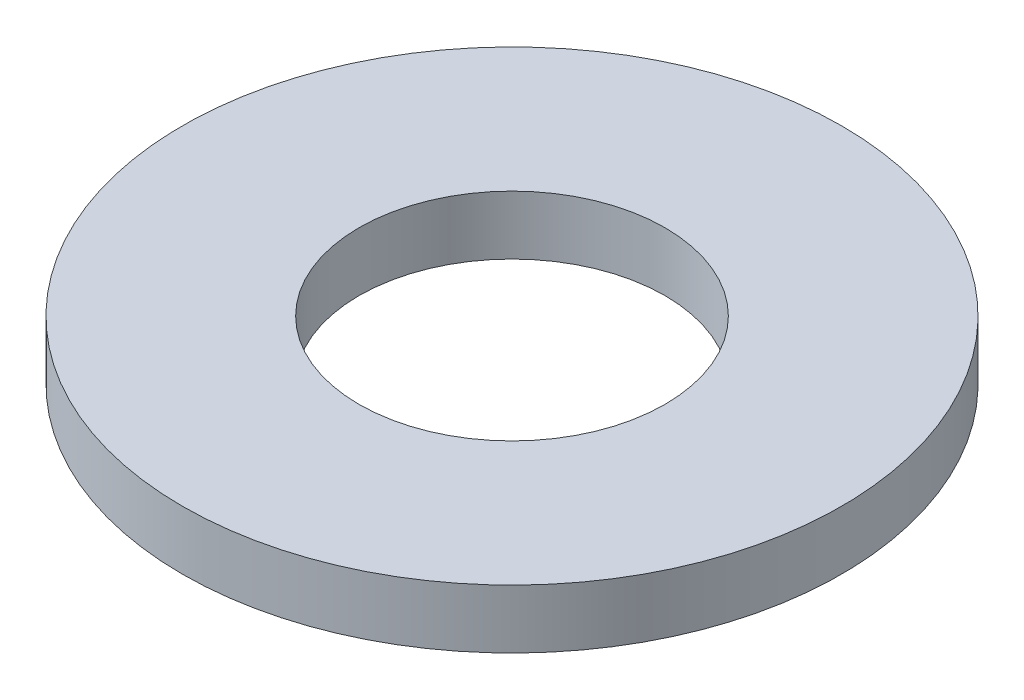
from build123d import *

# Parameters (mm, degrees)
ESQUISSE1_W = 3.75
ESQUISSE1_H = 1.25


with BuildPart() as part:
    # Esquisse1 → Base-R_volution (revolve)
    with BuildSketch(Plane.XY, mode=Mode.PRIVATE) as base_r_volution_sk:
        with Locations((5.125, 0.625)):
            Rectangle(ESQUISSE1_W, ESQUISSE1_H)
    revolve(base_r_volution_sk.sketch.rotate(Axis((0, 0, 0), (0, 1, 0)), 90), axis=Axis((0, 0, 0), (0, 1, 0)))


solid = part.part
